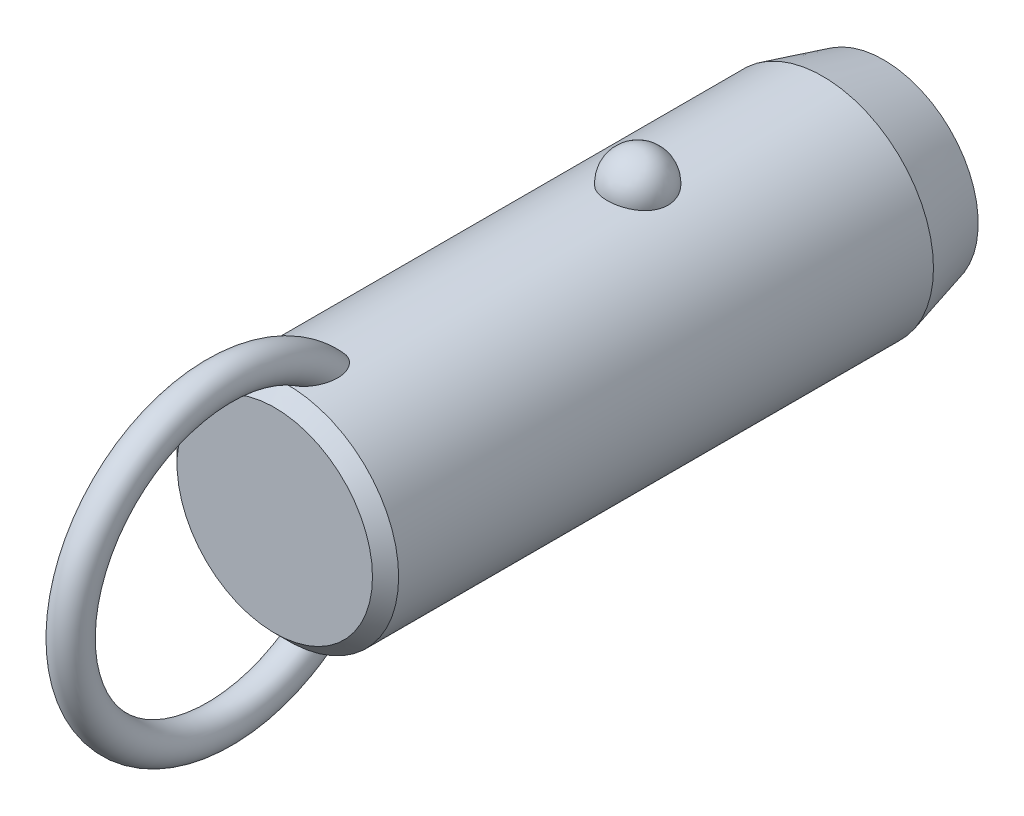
ISO-10303-21;
HEADER;
FILE_DESCRIPTION(('STEP AP214'),'2;1');
FILE_NAME('part.step','',(''),(''),'','','');
FILE_SCHEMA(('AUTOMOTIVE_DESIGN { 1 0 10303 214 1 1 1 1 }'));
ENDSEC;
DATA;
#1=APPLICATION_CONTEXT('core data for automotive mechanical design processes');
#2=APPLICATION_PROTOCOL_DEFINITION('international standard','automotive_design',2000,#1);
#3=PRODUCT_CONTEXT('',#1,'mechanical');
#4=PRODUCT('Part','Part','',(#3));
#5=PRODUCT_RELATED_PRODUCT_CATEGORY('part','',(#4));
#6=PRODUCT_DEFINITION_FORMATION('','',#4);
#7=PRODUCT_DEFINITION_CONTEXT('part definition',#1,'design');
#8=PRODUCT_DEFINITION('design','',#6,#7);
#9=PRODUCT_DEFINITION_SHAPE('','',#8);
#10=(LENGTH_UNIT() NAMED_UNIT(*) SI_UNIT(.MILLI.,.METRE.));
#11=(NAMED_UNIT(*) PLANE_ANGLE_UNIT() SI_UNIT($,.RADIAN.));
#12=(NAMED_UNIT(*) SI_UNIT($,.STERADIAN.) SOLID_ANGLE_UNIT());
#13=UNCERTAINTY_MEASURE_WITH_UNIT(LENGTH_MEASURE(1.E-05),#10,'distance_accuracy_value','');
#14=(GEOMETRIC_REPRESENTATION_CONTEXT(3) GLOBAL_UNCERTAINTY_ASSIGNED_CONTEXT((#13)) GLOBAL_UNIT_ASSIGNED_CONTEXT((#10,
#11,#12)) REPRESENTATION_CONTEXT('',''));
#15=CARTESIAN_POINT('',(0.,0.,0.));
#16=DIRECTION('',(0.,0.,1.));
#17=DIRECTION('',(1.,0.,0.));
#18=AXIS2_PLACEMENT_3D('',#15,#16,#17);
#19=CARTESIAN_POINT('',(0.,0.,25.4));
#20=DIRECTION('',(0.,0.,-1.));
#21=DIRECTION('',(-1.,0.,0.));
#22=AXIS2_PLACEMENT_3D('',#19,#20,#21);
#23=CYLINDRICAL_SURFACE('',#22,12.7);
#24=CARTESIAN_POINT('',(3.46661256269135,12.2177165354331,-3.5));
#25=CARTESIAN_POINT('',(3.4666090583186,12.2177194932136,-3.30432790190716));
#26=CARTESIAN_POINT('',(3.45063567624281,12.2222841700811,-3.10861112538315));
#27=CARTESIAN_POINT('',(3.38712451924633,12.2400345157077,-2.72271899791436));
#28=CARTESIAN_POINT('',(3.33957415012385,12.2532236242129,-2.53254588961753));
#29=CARTESIAN_POINT('',(3.2141234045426,12.286724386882,-2.16324948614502));
#30=CARTESIAN_POINT('',(3.13623639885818,12.3070329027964,-1.98412136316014));
#31=CARTESIAN_POINT('',(2.95205930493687,12.3525018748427,-1.64180592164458));
#32=CARTESIAN_POINT('',(2.84577003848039,12.3776621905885,-1.47861814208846));
#33=CARTESIAN_POINT('',(2.60688050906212,12.4301712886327,-1.17190583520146));
#34=CARTESIAN_POINT('',(2.47415697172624,12.4575299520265,-1.02847897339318));
#35=CARTESIAN_POINT('',(2.18615174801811,12.5112810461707,-0.766177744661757));
#36=CARTESIAN_POINT('',(2.03087002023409,12.5376734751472,-0.647303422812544));
#37=CARTESIAN_POINT('',(1.70237334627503,12.5864761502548,-0.437732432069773));
#38=CARTESIAN_POINT('',(1.52920948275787,12.6088972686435,-0.34695830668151));
#39=CARTESIAN_POINT('',(1.16944170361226,12.6473352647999,-0.195750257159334));
#40=CARTESIAN_POINT('',(0.982839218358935,12.663352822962,-0.135313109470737));
#41=CARTESIAN_POINT('',(0.604961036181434,12.6869706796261,-0.0473241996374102));
#42=CARTESIAN_POINT('',(0.413823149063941,12.6947125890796,-0.0192185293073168));
#43=CARTESIAN_POINT('',(0.0293827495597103,12.7014203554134,0.00517254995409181));
#44=CARTESIAN_POINT('',(-0.163919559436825,12.7003870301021,0.00146092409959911));
#45=CARTESIAN_POINT('',(-0.544374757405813,12.689735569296,-0.0373939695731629));
#46=CARTESIAN_POINT('',(-0.731575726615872,12.6802364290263,-0.0721015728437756));
#47=CARTESIAN_POINT('',(-1.09733277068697,12.6538333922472,-0.171364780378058));
#48=CARTESIAN_POINT('',(-1.27588869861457,12.6369293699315,-0.23592089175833));
#49=CARTESIAN_POINT('',(-1.6204698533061,12.5973946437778,-0.393548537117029));
#50=CARTESIAN_POINT('',(-1.78641865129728,12.5747321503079,-0.48677898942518));
#51=CARTESIAN_POINT('',(-2.10030671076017,12.5261316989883,-0.699110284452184));
#52=CARTESIAN_POINT('',(-2.24824419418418,12.5001934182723,-0.818213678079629));
#53=CARTESIAN_POINT('',(-2.52491489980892,12.4472906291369,-1.08157124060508));
#54=CARTESIAN_POINT('',(-2.65324222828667,12.4203160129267,-1.22624992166));
#55=CARTESIAN_POINT('',(-2.88410007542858,12.3687509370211,-1.53528325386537));
#56=CARTESIAN_POINT('',(-2.98662883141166,12.3441606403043,-1.69963924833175));
#57=CARTESIAN_POINT('',(-3.16432417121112,12.2998199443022,-2.04548497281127));
#58=CARTESIAN_POINT('',(-3.23917525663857,12.2801261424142,-2.22714424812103));
#59=CARTESIAN_POINT('',(-3.35800573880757,12.248167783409,-2.6009138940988));
#60=CARTESIAN_POINT('',(-3.4019860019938,12.2359030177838,-2.79302397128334));
#61=CARTESIAN_POINT('',(-3.45784812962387,12.2202347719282,-3.18140279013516));
#62=CARTESIAN_POINT('',(-3.46986123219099,12.2167950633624,-3.37765118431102));
#63=CARTESIAN_POINT('',(-3.46186273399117,12.2190638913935,-3.76943689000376));
#64=CARTESIAN_POINT('',(-3.44185196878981,12.2247721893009,-3.96497421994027));
#65=CARTESIAN_POINT('',(-3.37048652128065,12.2446381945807,-4.34881728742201));
#66=CARTESIAN_POINT('',(-3.31928253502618,12.2587552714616,-4.53715319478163));
#67=CARTESIAN_POINT('',(-3.18693461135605,12.2938237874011,-4.90231727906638));
#68=CARTESIAN_POINT('',(-3.1057895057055,12.3147754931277,-5.07914500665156));
#69=CARTESIAN_POINT('',(-2.91506431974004,12.3613125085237,-5.4173205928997));
#70=CARTESIAN_POINT('',(-2.80533587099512,12.3869217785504,-5.57858147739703));
#71=CARTESIAN_POINT('',(-2.560414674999,12.4398525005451,-5.88013283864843));
#72=CARTESIAN_POINT('',(-2.42522099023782,12.4671740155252,-6.02042254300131));
#73=CARTESIAN_POINT('',(-2.1323357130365,12.5205965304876,-6.27662798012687));
#74=CARTESIAN_POINT('',(-1.97456596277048,12.5466928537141,-6.39245542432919));
#75=CARTESIAN_POINT('',(-1.64115839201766,12.5946384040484,-6.59583547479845));
#76=CARTESIAN_POINT('',(-1.46552179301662,12.6164879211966,-6.68339001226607));
#77=CARTESIAN_POINT('',(-1.10356050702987,12.6532533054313,-6.82682153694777));
#78=CARTESIAN_POINT('',(-0.917391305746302,12.6682500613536,-6.88306988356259));
#79=CARTESIAN_POINT('',(-0.537836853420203,12.6900288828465,-6.96386887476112));
#80=CARTESIAN_POINT('',(-0.344452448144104,12.6968119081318,-6.9884232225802));
#81=CARTESIAN_POINT('',(0.0402577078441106,12.7013667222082,-7.00496469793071));
#82=CARTESIAN_POINT('',(0.231556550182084,12.6993008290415,-6.99753844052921));
#83=CARTESIAN_POINT('',(0.610105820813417,12.6867505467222,-6.95166366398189));
#84=CARTESIAN_POINT('',(0.797356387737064,12.6762664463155,-6.91321620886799));
#85=CARTESIAN_POINT('',(1.16186657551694,12.6480587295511,-6.80658431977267));
#86=CARTESIAN_POINT('',(1.33915951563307,12.6303611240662,-6.73850666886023));
#87=CARTESIAN_POINT('',(1.67968518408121,12.5896027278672,-6.57450875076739));
#88=CARTESIAN_POINT('',(1.84291705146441,12.5665416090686,-6.47858678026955));
#89=CARTESIAN_POINT('',(2.15340192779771,12.5171072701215,-6.25982455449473));
#90=CARTESIAN_POINT('',(2.30037831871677,12.4906895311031,-6.13660186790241));
#91=CARTESIAN_POINT('',(2.5717412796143,12.4376567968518,-5.86739587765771));
#92=CARTESIAN_POINT('',(2.69612388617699,12.4110417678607,-5.72140858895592));
#93=CARTESIAN_POINT('',(2.92107785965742,12.360051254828,-5.40794137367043));
#94=CARTESIAN_POINT('',(3.02121329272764,12.3357209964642,-5.24014110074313));
#95=CARTESIAN_POINT('',(3.19236291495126,12.2925446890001,-4.8896986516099));
#96=CARTESIAN_POINT('',(3.26338839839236,12.2736965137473,-4.70706226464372));
#97=CARTESIAN_POINT('',(3.36788038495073,12.245404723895,-4.35469510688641));
#98=CARTESIAN_POINT('',(3.40484026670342,12.2351018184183,-4.18605935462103));
#99=CARTESIAN_POINT('',(3.45420764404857,12.2212564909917,-3.84496058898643));
#100=CARTESIAN_POINT('',(3.46661565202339,12.2177139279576,-3.67249765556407));
#101=CARTESIAN_POINT('',(3.46661256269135,12.2177165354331,-3.5));
#102=B_SPLINE_CURVE_WITH_KNOTS('',3,(#24,#25,#26,#27,#28,#29,#30,#31,#32,#33,#34,#35,#36,#37,
#38,#39,#40,#41,#42,#43,#44,#45,#46,#47,#48,#49,#50,#51,#52,#53,#54,#55,#56,#57,#58,#59,#60,#61,
#62,#63,#64,#65,#66,#67,#68,#69,#70,#71,#72,#73,#74,#75,#76,#77,#78,#79,#80,#81,#82,#83,#84,#85,
#86,#87,#88,#89,#90,#91,#92,#93,#94,#95,#96,#97,#98,#99,#100,#101),.UNSPECIFIED.,.T.,.F.,(4,2,2,
2,2,2,2,2,2,2,2,2,2,2,2,2,2,2,2,2,2,2,2,2,2,2,2,2,2,2,2,2,2,2,2,2,2,2,4),(0.,0.586396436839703,
1.17302689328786,1.7593990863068,2.34575431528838,2.93491084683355,3.52406845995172,
4.1115873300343,4.69904375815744,5.2762784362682,5.85345931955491,6.42265312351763,
6.99185659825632,7.56427334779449,8.136746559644,8.71981013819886,9.3029135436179,
9.89247258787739,10.4820150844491,11.0691335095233,11.6562366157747,12.2405256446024,
12.8248374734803,13.412244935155,13.9996740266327,14.5891883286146,15.1786623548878,
15.7609861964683,16.3432419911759,16.914863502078,17.4864654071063,18.056024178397,
18.6256177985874,19.2037609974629,19.7820055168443,20.3699810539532,20.9577282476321,
21.4746855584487,21.9916320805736),.UNSPECIFIED.);
#103=CARTESIAN_POINT('',(3.46661256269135,12.2177165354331,-3.5));
#104=VERTEX_POINT('',#103);
#105=EDGE_CURVE('E41',#104,#104,#102,.T.);
#106=ORIENTED_EDGE('',*,*,#105,.T.);
#107=EDGE_LOOP('',(#106));
#108=FACE_BOUND('',#107,.T.);
#109=CARTESIAN_POINT('',(0.,0.,36.6));
#110=DIRECTION('',(0.,0.,1.));
#111=DIRECTION('',(1.,0.,0.));
#112=AXIS2_PLACEMENT_3D('',#109,#110,#111);
#113=CIRCLE('',#112,12.7);
#114=CARTESIAN_POINT('',(12.7,0.,36.6));
#115=VERTEX_POINT('',#114);
#116=EDGE_CURVE('E10',#115,#115,#113,.F.);
#117=ORIENTED_EDGE('',*,*,#116,.T.);
#118=EDGE_LOOP('',(#117));
#119=FACE_BOUND('',#118,.T.);
#120=CARTESIAN_POINT('',(-0.548122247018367,-12.6881662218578,30.3432187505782));
#121=CARTESIAN_POINT('',(-0.648865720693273,-12.6838128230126,30.377926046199));
#122=CARTESIAN_POINT('',(-0.746398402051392,-12.6783867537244,30.4220428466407));
#123=CARTESIAN_POINT('',(-0.932125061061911,-12.666091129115,30.5267647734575));
#124=CARTESIAN_POINT('',(-1.02030388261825,-12.6592192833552,30.5873961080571));
#125=CARTESIAN_POINT('',(-1.18487740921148,-12.6448747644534,30.721847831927));
#126=CARTESIAN_POINT('',(-1.26134296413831,-12.637406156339,30.7955825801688));
#127=CARTESIAN_POINT('',(-1.4023120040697,-12.6225412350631,30.9536045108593));
#128=CARTESIAN_POINT('',(-1.46681470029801,-12.6151449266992,31.0378923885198));
#129=CARTESIAN_POINT('',(-1.60714786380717,-12.5981718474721,31.2496577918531));
#130=CARTESIAN_POINT('',(-1.67725126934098,-12.588900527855,31.380962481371));
#131=CARTESIAN_POINT('',(-1.79536591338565,-12.5725964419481,31.6532471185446));
#132=CARTESIAN_POINT('',(-1.84333535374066,-12.5655679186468,31.7942447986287));
#133=CARTESIAN_POINT('',(-1.93422576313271,-12.5519624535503,32.1376455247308));
#134=CARTESIAN_POINT('',(-1.96788773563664,-12.5466298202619,32.3425578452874));
#135=CARTESIAN_POINT('',(-1.9941399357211,-12.542463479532,32.6517600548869));
#136=CARTESIAN_POINT('',(-1.99883864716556,-12.5417153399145,32.7552987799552));
#137=CARTESIAN_POINT('',(-2.00078003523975,-12.5414074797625,32.9624512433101));
#138=CARTESIAN_POINT('',(-1.99802449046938,-12.5418474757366,33.0660649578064));
#139=CARTESIAN_POINT('',(-1.98336733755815,-12.5441750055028,33.3103207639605));
#140=CARTESIAN_POINT('',(-1.96851430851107,-12.5465291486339,33.4507804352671));
#141=CARTESIAN_POINT('',(-1.92707089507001,-12.5529612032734,33.7299607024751));
#142=CARTESIAN_POINT('',(-1.900474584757,-12.5570399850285,33.8686803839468));
#143=CARTESIAN_POINT('',(-1.83619120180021,-12.5666008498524,34.1434113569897));
#144=CARTESIAN_POINT('',(-1.79850828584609,-12.57208240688,34.2794236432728));
#145=CARTESIAN_POINT('',(-1.71223796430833,-12.5841228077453,34.5478421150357));
#146=CARTESIAN_POINT('',(-1.66365679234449,-12.5906810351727,34.6802503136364));
#147=CARTESIAN_POINT('',(-1.57804503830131,-12.6016176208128,34.8854887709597));
#148=CARTESIAN_POINT('',(-1.54477252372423,-12.6057501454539,34.9599149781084));
#149=CARTESIAN_POINT('',(-1.47424480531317,-12.6141930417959,35.1068393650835));
#150=CARTESIAN_POINT('',(-1.43699041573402,-12.6185033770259,35.1793379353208));
#151=CARTESIAN_POINT('',(-1.35825795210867,-12.6272207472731,35.3218926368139));
#152=CARTESIAN_POINT('',(-1.31678520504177,-12.6316276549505,35.3919517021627));
#153=CARTESIAN_POINT('',(-1.22917793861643,-12.6404532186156,35.5290705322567));
#154=CARTESIAN_POINT('',(-1.18304514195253,-12.6448718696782,35.5961313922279));
#155=CARTESIAN_POINT('',(-1.0724641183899,-12.6547893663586,35.7438741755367));
#156=CARTESIAN_POINT('',(-1.00642239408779,-12.6602600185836,35.8233844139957));
#157=CARTESIAN_POINT('',(-0.86444142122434,-12.6707460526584,35.9731698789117));
#158=CARTESIAN_POINT('',(-0.788516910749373,-12.6757620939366,36.0434585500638));
#159=CARTESIAN_POINT('',(-0.652215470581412,-12.6833591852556,36.1486801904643));
#160=CARTESIAN_POINT('',(-0.594982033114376,-12.6861973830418,36.1876241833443));
#161=CARTESIAN_POINT('',(-0.475269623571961,-12.6912445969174,36.2564899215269));
#162=CARTESIAN_POINT('',(-0.412800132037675,-12.6934547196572,36.2864275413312));
#163=CARTESIAN_POINT('',(-0.295749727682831,-12.6966636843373,36.3297565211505));
#164=CARTESIAN_POINT('',(-0.241949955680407,-12.6978134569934,36.3452188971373));
#165=CARTESIAN_POINT('',(-0.132508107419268,-12.6994261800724,36.3668845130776));
#166=CARTESIAN_POINT('',(-0.076867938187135,-12.6998898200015,36.3730970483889));
#167=CARTESIAN_POINT('',(0.0347696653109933,-12.7000752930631,36.3755838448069));
#168=CARTESIAN_POINT('',(0.0907676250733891,-12.6997954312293,36.3718353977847));
#169=CARTESIAN_POINT('',(0.201283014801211,-12.6985255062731,36.3547883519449));
#170=CARTESIAN_POINT('',(0.255799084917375,-12.6975348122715,36.3414812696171));
#171=CARTESIAN_POINT('',(0.376042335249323,-12.6946091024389,36.3020379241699));
#172=CARTESIAN_POINT('',(0.44095085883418,-12.6924943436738,36.2734492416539));
#173=CARTESIAN_POINT('',(0.565350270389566,-12.6875639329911,36.2063234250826));
#174=CARTESIAN_POINT('',(0.624828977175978,-12.6847467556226,36.1677646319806));
#175=CARTESIAN_POINT('',(0.77411610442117,-12.6767252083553,36.056949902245));
#176=CARTESIAN_POINT('',(0.859449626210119,-12.6711344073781,35.9787605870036));
#177=CARTESIAN_POINT('',(1.01789440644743,-12.6593922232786,35.810943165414));
#178=CARTESIAN_POINT('',(1.09096902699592,-12.653239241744,35.721282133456));
#179=CARTESIAN_POINT('',(1.22268793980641,-12.6411674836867,35.5402658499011));
#180=CARTESIAN_POINT('',(1.28193986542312,-12.6352572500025,35.4493459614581));
#181=CARTESIAN_POINT('',(1.39259777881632,-12.6235401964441,35.262792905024));
#182=CARTESIAN_POINT('',(1.44399707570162,-12.6177334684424,35.167155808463));
#183=CARTESIAN_POINT('',(1.53972870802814,-12.6064093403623,34.9722738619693));
#184=CARTESIAN_POINT('',(1.58405262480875,-12.6008922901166,34.8730248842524));
#185=CARTESIAN_POINT('',(1.66600705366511,-12.5903187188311,34.6717727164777));
#186=CARTESIAN_POINT('',(1.70363651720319,-12.5852622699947,34.5697690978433));
#187=CARTESIAN_POINT('',(1.77545379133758,-12.5753406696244,34.3543580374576));
#188=CARTESIAN_POINT('',(1.80903453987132,-12.5705328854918,34.240745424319));
#189=CARTESIAN_POINT('',(1.86844163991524,-12.5618400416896,34.0114575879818));
#190=CARTESIAN_POINT('',(1.89426665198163,-12.5579551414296,33.8957820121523));
#191=CARTESIAN_POINT('',(1.93785464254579,-12.5513030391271,33.6630072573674));
#192=CARTESIAN_POINT('',(1.9556264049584,-12.5485346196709,33.5459097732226));
#193=CARTESIAN_POINT('',(1.98264463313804,-12.5442934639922,33.3107473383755));
#194=CARTESIAN_POINT('',(1.99189298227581,-12.5428204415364,33.1926826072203));
#195=CARTESIAN_POINT('',(2.00416068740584,-12.540871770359,32.8806225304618));
#196=CARTESIAN_POINT('',(1.99944433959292,-12.541631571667,32.6862290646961));
#197=CARTESIAN_POINT('',(1.96113755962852,-12.5476846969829,32.3003095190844));
#198=CARTESIAN_POINT('',(1.92758341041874,-12.5529723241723,32.1087801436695));
#199=CARTESIAN_POINT('',(1.83934342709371,-12.5661532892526,31.7822728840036));
#200=CARTESIAN_POINT('',(1.79215440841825,-12.5730485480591,31.6452499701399));
#201=CARTESIAN_POINT('',(1.6767624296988,-12.588958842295,31.380445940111));
#202=CARTESIAN_POINT('',(1.60859050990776,-12.597970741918,31.2526515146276));
#203=CARTESIAN_POINT('',(1.46583832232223,-12.6152829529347,31.0358006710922));
#204=CARTESIAN_POINT('',(1.39525727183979,-12.6233659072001,30.9441050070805));
#205=CARTESIAN_POINT('',(1.23992594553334,-12.6395676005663,30.7734854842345));
#206=CARTESIAN_POINT('',(1.15517932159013,-12.6476863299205,30.6945583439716));
#207=CARTESIAN_POINT('',(0.971995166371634,-12.6630846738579,30.5526438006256));
#208=CARTESIAN_POINT('',(0.873456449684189,-12.6703572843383,30.4897849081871));
#209=CARTESIAN_POINT('',(0.665847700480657,-12.6829569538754,30.3844870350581));
#210=CARTESIAN_POINT('',(0.556784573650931,-12.688285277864,30.3420347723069));
#211=CARTESIAN_POINT('',(0.347338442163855,-12.6956226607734,30.2844434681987));
#212=CARTESIAN_POINT('',(0.247759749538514,-12.6979816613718,30.2663996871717));
#213=CARTESIAN_POINT('',(0.0470218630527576,-12.7003077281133,30.2486007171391));
#214=CARTESIAN_POINT('',(-0.0541350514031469,-12.7002779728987,30.2488212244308));
#215=CARTESIAN_POINT('',(-0.221414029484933,-12.6982482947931,30.2643639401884));
#216=CARTESIAN_POINT('',(-0.288055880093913,-12.6969033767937,30.2746662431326));
#217=CARTESIAN_POINT('',(-0.419599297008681,-12.6932369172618,30.3031348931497));
#218=CARTESIAN_POINT('',(-0.484501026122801,-12.6909154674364,30.3213005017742));
#219=CARTESIAN_POINT('',(-0.548122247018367,-12.6881662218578,30.3432187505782));
#220=B_SPLINE_CURVE_WITH_KNOTS('',3,(#120,#121,#122,#123,#124,#125,#126,#127,#128,#129,#130,
#131,#132,#133,#134,#135,#136,#137,#138,#139,#140,#141,#142,#143,#144,#145,#146,#147,#148,#149,
#150,#151,#152,#153,#154,#155,#156,#157,#158,#159,#160,#161,#162,#163,#164,#165,#166,#167,#168,
#169,#170,#171,#172,#173,#174,#175,#176,#177,#178,#179,#180,#181,#182,#183,#184,#185,#186,#187,
#188,#189,#190,#191,#192,#193,#194,#195,#196,#197,#198,#199,#200,#201,#202,#203,#204,#205,#206,
#207,#208,#209,#210,#211,#212,#213,#214,#215,#216,#217,#218,#219),.UNSPECIFIED.,.T.,.F.,(4,2,2,
2,2,2,2,2,2,2,2,2,2,2,2,2,2,2,2,2,2,2,2,2,2,2,2,2,2,2,2,2,2,2,2,2,2,2,2,2,2,2,2,2,2,2,2,2,2,4),
(0.,0.319642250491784,0.639794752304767,0.957927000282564,1.27608021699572,1.72100165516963,
2.16675988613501,2.78630021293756,3.09705782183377,3.40774128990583,3.83096358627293,
4.25439969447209,4.67767724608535,5.10071330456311,5.34550297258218,5.59024267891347,
5.83467707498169,6.07902143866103,6.38891080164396,6.69834321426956,6.90560910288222,
7.11250749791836,7.27977315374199,7.44687060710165,7.61434932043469,7.78197685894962,
7.99365544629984,8.20579780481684,8.55147335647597,8.89816429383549,9.22375138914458,
9.54961437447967,9.87586224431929,10.2021611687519,10.557587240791,10.9130746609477,
11.2681734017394,11.6231936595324,12.2046601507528,12.7853961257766,13.219164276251,
13.6522938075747,13.9989174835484,14.3454519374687,14.6946768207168,15.0436740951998,
15.3457513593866,15.6474266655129,15.8493051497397,16.0511646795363),.UNSPECIFIED.);
#221=CARTESIAN_POINT('',(-0.548122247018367,-12.6881662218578,30.3432187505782));
#222=VERTEX_POINT('',#221);
#223=EDGE_CURVE('E60',#222,#222,#220,.T.);
#224=ORIENTED_EDGE('',*,*,#223,.T.);
#225=EDGE_LOOP('',(#224));
#226=FACE_BOUND('',#225,.T.);
#227=CARTESIAN_POINT('',(-0.548122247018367,12.6881662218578,30.3432187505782));
#228=CARTESIAN_POINT('',(-0.459436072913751,12.6919968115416,30.312673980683));
#229=CARTESIAN_POINT('',(-0.368189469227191,12.6949996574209,30.2893913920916));
#230=CARTESIAN_POINT('',(-0.183024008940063,12.6990186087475,30.2584062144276));
#231=CARTESIAN_POINT('',(-0.0891049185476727,12.7000345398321,30.2507049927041));
#232=CARTESIAN_POINT('',(0.0987147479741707,12.6999636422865,30.2512455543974));
#233=CARTESIAN_POINT('',(0.192615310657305,12.6988761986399,30.2594920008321));
#234=CARTESIAN_POINT('',(0.377658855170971,12.6947211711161,30.2915515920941));
#235=CARTESIAN_POINT('',(0.468801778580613,12.6916535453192,30.3153650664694));
#236=CARTESIAN_POINT('',(0.645809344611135,12.6838788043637,30.3774565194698));
#237=CARTESIAN_POINT('',(0.731679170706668,12.6791733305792,30.415720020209));
#238=CARTESIAN_POINT('',(0.896315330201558,12.6686004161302,30.5051204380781));
#239=CARTESIAN_POINT('',(0.975080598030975,12.6627328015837,30.5562592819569));
#240=CARTESIAN_POINT('',(1.12963655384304,12.6499161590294,30.6736782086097));
#241=CARTESIAN_POINT('',(1.20478673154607,12.6429194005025,30.7407929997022));
#242=CARTESIAN_POINT('',(1.34448241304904,12.6288282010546,30.8852250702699));
#243=CARTESIAN_POINT('',(1.40902173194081,12.621733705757,30.9625482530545));
#244=CARTESIAN_POINT('',(1.55208211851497,12.6050877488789,31.1592475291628));
#245=CARTESIAN_POINT('',(1.62510490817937,12.5957546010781,31.2826540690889));
#246=CARTESIAN_POINT('',(1.7501904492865,12.5789823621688,31.5397690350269));
#247=CARTESIAN_POINT('',(1.80221377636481,12.5715468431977,31.673496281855));
#248=CARTESIAN_POINT('',(1.90309965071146,12.5567434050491,31.9983516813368));
#249=CARTESIAN_POINT('',(1.94342317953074,12.5504515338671,32.1921611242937));
#250=CARTESIAN_POINT('',(1.99332997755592,12.5426147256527,32.5837881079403));
#251=CARTESIAN_POINT('',(2.00285305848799,12.5410790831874,32.7816127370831));
#252=CARTESIAN_POINT('',(1.99678999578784,12.5420407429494,33.1166427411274));
#253=CARTESIAN_POINT('',(1.98794117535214,12.5434564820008,33.2540428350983));
#254=CARTESIAN_POINT('',(1.95865119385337,12.5480641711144,33.5276394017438));
#255=CARTESIAN_POINT('',(1.9382043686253,12.5512569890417,33.6638352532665));
#256=CARTESIAN_POINT('',(1.88647896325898,12.5591352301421,33.9342493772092));
#257=CARTESIAN_POINT('',(1.85518800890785,12.5638223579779,34.0684652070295));
#258=CARTESIAN_POINT('',(1.78217886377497,12.5743868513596,34.3339362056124));
#259=CARTESIAN_POINT('',(1.74046509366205,12.5802637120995,34.4651926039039));
#260=CARTESIAN_POINT('',(1.66024095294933,12.5910571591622,34.6860855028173));
#261=CARTESIAN_POINT('',(1.62434772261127,12.5957535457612,34.7766904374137));
#262=CARTESIAN_POINT('',(1.5470900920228,12.6054762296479,34.9555125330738));
#263=CARTESIAN_POINT('',(1.50572681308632,12.6105024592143,35.0437301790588));
#264=CARTESIAN_POINT('',(1.41728020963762,12.620748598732,35.2169321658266));
#265=CARTESIAN_POINT('',(1.37021377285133,12.625967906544,35.3019251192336));
#266=CARTESIAN_POINT('',(1.26969620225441,12.6364721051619,35.4680072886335));
#267=CARTESIAN_POINT('',(1.21624929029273,12.6417569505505,35.5490990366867));
#268=CARTESIAN_POINT('',(1.10304413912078,12.6521331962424,35.7047027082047));
#269=CARTESIAN_POINT('',(1.04340936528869,12.657226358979,35.7793033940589));
#270=CARTESIAN_POINT('',(0.91591933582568,12.6670906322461,35.921324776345));
#271=CARTESIAN_POINT('',(0.848064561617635,12.6718617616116,35.9887458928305));
#272=CARTESIAN_POINT('',(0.717035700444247,12.67987711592,36.1006247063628));
#273=CARTESIAN_POINT('',(0.655526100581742,12.6832377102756,36.1469970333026));
#274=CARTESIAN_POINT('',(0.525985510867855,12.6892676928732,36.2296195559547));
#275=CARTESIAN_POINT('',(0.457969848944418,12.6919386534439,36.2658927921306));
#276=CARTESIAN_POINT('',(0.334859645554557,12.695691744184,36.3166572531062));
#277=CARTESIAN_POINT('',(0.281116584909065,12.6970073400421,36.3343733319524));
#278=CARTESIAN_POINT('',(0.171425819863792,12.6989609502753,36.3606429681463));
#279=CARTESIAN_POINT('',(0.115480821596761,12.699599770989,36.3692074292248));
#280=CARTESIAN_POINT('',(0.00272618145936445,12.7001251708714,36.3762531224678));
#281=CARTESIAN_POINT('',(-0.0540859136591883,12.7000089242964,36.3746964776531));
#282=CARTESIAN_POINT('',(-0.166544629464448,12.6990328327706,36.3616005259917));
#283=CARTESIAN_POINT('',(-0.222190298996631,12.6981724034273,36.3500533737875));
#284=CARTESIAN_POINT('',(-0.342018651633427,12.695562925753,36.3149128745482));
#285=CARTESIAN_POINT('',(-0.40560689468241,12.6936676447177,36.2893322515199));
#286=CARTESIAN_POINT('',(-0.527815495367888,12.6891754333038,36.228311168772));
#287=CARTESIAN_POINT('',(-0.586425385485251,12.6865770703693,36.1928505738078));
#288=CARTESIAN_POINT('',(-0.731842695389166,12.6792129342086,36.0914960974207));
#289=CARTESIAN_POINT('',(-0.814709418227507,12.6740767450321,36.0200395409));
#290=CARTESIAN_POINT('',(-0.969101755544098,12.6632083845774,35.8658900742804));
#291=CARTESIAN_POINT('',(-1.04059564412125,12.6574746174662,35.7831668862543));
#292=CARTESIAN_POINT('',(-1.16981116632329,12.6461638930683,35.6158096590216));
#293=CARTESIAN_POINT('',(-1.22811369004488,12.6405994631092,35.5316166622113));
#294=CARTESIAN_POINT('',(-1.33743405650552,12.6295007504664,35.3585791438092));
#295=CARTESIAN_POINT('',(-1.38844577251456,12.6239664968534,35.2697307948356));
#296=CARTESIAN_POINT('',(-1.48400702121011,12.6130898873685,35.088389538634));
#297=CARTESIAN_POINT('',(-1.52854232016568,12.6077479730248,34.9958891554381));
#298=CARTESIAN_POINT('',(-1.6115011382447,12.5974127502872,34.8081607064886));
#299=CARTESIAN_POINT('',(-1.64992317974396,12.5924195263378,34.7129319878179));
#300=CARTESIAN_POINT('',(-1.73468589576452,12.581070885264,34.4828936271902));
#301=CARTESIAN_POINT('',(-1.77831261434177,12.5749388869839,34.3470661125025));
#302=CARTESIAN_POINT('',(-1.85439734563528,12.5639437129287,34.0722128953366));
#303=CARTESIAN_POINT('',(-1.88684994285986,12.5590811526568,33.9331856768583));
#304=CARTESIAN_POINT('',(-1.94008483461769,12.550968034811,33.6530923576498));
#305=CARTESIAN_POINT('',(-1.96088706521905,12.5477147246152,33.5120301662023));
#306=CARTESIAN_POINT('',(-1.99000539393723,12.5431291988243,33.2286689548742));
#307=CARTESIAN_POINT('',(-1.99832911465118,12.5417958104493,33.0863707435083));
#308=CARTESIAN_POINT('',(-2.00166624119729,12.5412674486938,32.7576271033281));
#309=CARTESIAN_POINT('',(-1.99178843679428,12.5428579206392,32.571088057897));
#310=CARTESIAN_POINT('',(-1.9445518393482,12.5502731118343,32.2016240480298));
#311=CARTESIAN_POINT('',(-1.90724032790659,12.5560905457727,32.0186934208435));
#312=CARTESIAN_POINT('',(-1.81330718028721,12.5699462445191,31.7048488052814));
#313=CARTESIAN_POINT('',(-1.76338820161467,12.5771273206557,31.5719105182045));
#314=CARTESIAN_POINT('',(-1.64305018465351,12.593414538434,31.3156813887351));
#315=CARTESIAN_POINT('',(-1.57265346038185,12.6025185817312,31.192380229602));
#316=CARTESIAN_POINT('',(-1.42634956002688,12.6198178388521,30.9835648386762));
#317=CARTESIAN_POINT('',(-1.35423772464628,12.6278405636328,30.8953846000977));
#318=CARTESIAN_POINT('',(-1.19645664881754,12.6437632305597,30.732107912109));
#319=CARTESIAN_POINT('',(-1.11080536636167,12.6516633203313,30.6569944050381));
#320=CARTESIAN_POINT('',(-0.947219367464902,12.6648319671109,30.5378114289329));
#321=CARTESIAN_POINT('',(-0.871624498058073,12.670300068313,30.4905414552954));
#322=CARTESIAN_POINT('',(-0.714161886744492,12.6801492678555,30.4077413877));
#323=CARTESIAN_POINT('',(-0.6322953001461,12.684530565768,30.3722091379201));
#324=CARTESIAN_POINT('',(-0.548122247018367,12.6881662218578,30.3432187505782));
#325=B_SPLINE_CURVE_WITH_KNOTS('',3,(#227,#228,#229,#230,#231,#232,#233,#234,#235,#236,#237,
#238,#239,#240,#241,#242,#243,#244,#245,#246,#247,#248,#249,#250,#251,#252,#253,#254,#255,#256,
#257,#258,#259,#260,#261,#262,#263,#264,#265,#266,#267,#268,#269,#270,#271,#272,#273,#274,#275,
#276,#277,#278,#279,#280,#281,#282,#283,#284,#285,#286,#287,#288,#289,#290,#291,#292,#293,#294,
#295,#296,#297,#298,#299,#300,#301,#302,#303,#304,#305,#306,#307,#308,#309,#310,#311,#312,#313,
#314,#315,#316,#317,#318,#319,#320,#321,#322,#323,#324),.UNSPECIFIED.,.T.,.F.,(4,2,2,2,2,2,2,2,
2,2,2,2,2,2,2,2,2,2,2,2,2,2,2,2,2,2,2,2,2,2,2,2,2,2,2,2,2,2,2,2,2,2,2,2,2,2,2,2,4),(0.,
0.281328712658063,0.562682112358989,0.844117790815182,1.12555942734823,1.40671982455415,
1.68792232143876,1.98972294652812,2.2916988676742,2.72039860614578,3.1498994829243,
3.7408491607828,4.33295293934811,4.74554109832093,5.15833092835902,5.57159335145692,
5.98468079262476,6.27722775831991,6.56971484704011,6.86135609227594,7.15280542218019,
7.43927407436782,7.72572595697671,7.9563586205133,8.18646071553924,8.35559393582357,
8.52452541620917,8.69408946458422,8.86378678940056,9.06834348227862,9.27332014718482,
9.60010414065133,9.92778432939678,10.2350252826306,10.5425229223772,10.8506864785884,
11.1589244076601,11.5867893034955,12.0148612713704,12.4421984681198,12.8692745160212,
13.4279365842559,13.9856380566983,14.4107062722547,14.8353130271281,15.1765567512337,
15.5173516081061,15.7844129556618,16.051425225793),.UNSPECIFIED.);
#326=CARTESIAN_POINT('',(-0.548122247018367,12.6881662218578,30.3432187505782));
#327=VERTEX_POINT('',#326);
#328=EDGE_CURVE('E68',#327,#327,#325,.T.);
#329=ORIENTED_EDGE('',*,*,#328,.T.);
#330=EDGE_LOOP('',(#329));
#331=FACE_BOUND('',#330,.T.);
#332=CARTESIAN_POINT('',(0.,0.,-24.6999999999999));
#333=DIRECTION('',(0.,0.,-1.));
#334=DIRECTION('',(-1.,0.,0.));
#335=AXIS2_PLACEMENT_3D('',#332,#333,#334);
#336=CIRCLE('',#335,12.7);
#337=CARTESIAN_POINT('',(-12.7,0.,-24.6999999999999));
#338=VERTEX_POINT('',#337);
#339=EDGE_CURVE('E57',#338,#338,#336,.F.);
#340=ORIENTED_EDGE('',*,*,#339,.T.);
#341=EDGE_LOOP('',(#340));
#342=FACE_BOUND('',#341,.T.);
#343=ADVANCED_FACE('F37',(#108,#119,#226,#331,#342),#23,.T.);
#344=CARTESIAN_POINT('',(0.,0.,-31.7));
#345=DIRECTION('',(0.,0.,-1.));
#346=DIRECTION('',(-1.,0.,0.));
#347=AXIS2_PLACEMENT_3D('',#344,#345,#346);
#348=PLANE('',#347);
#349=CARTESIAN_POINT('',(0.,0.,-31.7));
#350=DIRECTION('',(0.,0.,-1.));
#351=DIRECTION('',(-1.,0.,0.));
#352=AXIS2_PLACEMENT_3D('',#349,#350,#351);
#353=CIRCLE('',#352,10.8243556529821);
#354=CARTESIAN_POINT('',(-10.8243556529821,0.,-31.7));
#355=VERTEX_POINT('',#354);
#356=EDGE_CURVE('E67',#355,#355,#353,.T.);
#357=ORIENTED_EDGE('',*,*,#356,.T.);
#358=EDGE_LOOP('',(#357));
#359=FACE_BOUND('',#358,.T.);
#360=ADVANCED_FACE('F86',(#359),#348,.T.);
#361=CARTESIAN_POINT('',(0.,0.,-31.7));
#362=DIRECTION('',(0.,0.,1.));
#363=DIRECTION('',(1.,0.,0.));
#364=AXIS2_PLACEMENT_3D('',#361,#362,#363);
#365=CONICAL_SURFACE('',#364,10.8243556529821,0.261799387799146);
#366=ORIENTED_EDGE('',*,*,#339,.F.);
#367=EDGE_LOOP('',(#366));
#368=FACE_BOUND('',#367,.T.);
#369=ORIENTED_EDGE('',*,*,#356,.F.);
#370=EDGE_LOOP('',(#369));
#371=FACE_BOUND('',#370,.T.);
#372=ADVANCED_FACE('F84',(#368,#371),#365,.T.);
#373=CARTESIAN_POINT('',(0.,0.,38.1));
#374=DIRECTION('',(0.,0.,1.));
#375=DIRECTION('',(1.,0.,0.));
#376=AXIS2_PLACEMENT_3D('',#373,#374,#375);
#377=PLANE('',#376);
#378=CARTESIAN_POINT('',(0.,0.,38.1));
#379=DIRECTION('',(0.,0.,1.));
#380=DIRECTION('',(1.,0.,0.));
#381=AXIS2_PLACEMENT_3D('',#378,#379,#380);
#382=CIRCLE('',#381,11.2);
#383=CARTESIAN_POINT('',(11.2,0.,38.1));
#384=VERTEX_POINT('',#383);
#385=EDGE_CURVE('E50',#384,#384,#382,.T.);
#386=ORIENTED_EDGE('',*,*,#385,.T.);
#387=EDGE_LOOP('',(#386));
#388=FACE_BOUND('',#387,.T.);
#389=ADVANCED_FACE('F78',(#388),#377,.T.);
#390=CARTESIAN_POINT('',(0.,0.,44.45));
#391=DIRECTION('',(1.,0.,0.));
#392=DIRECTION('',(0.,0.,-1.));
#393=AXIS2_PLACEMENT_3D('',#390,#391,#392);
#394=TOROIDAL_SURFACE('',#393,17.05,2.);
#395=ORIENTED_EDGE('',*,*,#328,.F.);
#396=EDGE_LOOP('',(#395));
#397=FACE_BOUND('',#396,.T.);
#398=ORIENTED_EDGE('',*,*,#223,.F.);
#399=EDGE_LOOP('',(#398));
#400=FACE_BOUND('',#399,.T.);
#401=ADVANCED_FACE('F74',(#397,#400),#394,.T.);
#402=CARTESIAN_POINT('',(0.,0.,38.1));
#403=DIRECTION('',(0.,0.,-1.));
#404=DIRECTION('',(-1.,0.,0.));
#405=AXIS2_PLACEMENT_3D('',#402,#403,#404);
#406=CONICAL_SURFACE('',#405,11.2,0.785398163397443);
#407=ORIENTED_EDGE('',*,*,#116,.F.);
#408=EDGE_LOOP('',(#407));
#409=FACE_BOUND('',#408,.T.);
#410=ORIENTED_EDGE('',*,*,#385,.F.);
#411=EDGE_LOOP('',(#410));
#412=FACE_BOUND('',#411,.T.);
#413=ADVANCED_FACE('F39',(#409,#412),#406,.T.);
#414=CARTESIAN_POINT('',(0.,12.7,-3.5));
#415=DIRECTION('',(0.,1.,0.));
#416=DIRECTION('',(0.,0.,1.));
#417=AXIS2_PLACEMENT_3D('',#414,#415,#416);
#418=SPHERICAL_SURFACE('',#417,3.5);
#419=ORIENTED_EDGE('',*,*,#105,.F.);
#420=EDGE_LOOP('',(#419));
#421=FACE_BOUND('',#420,.T.);
#422=ADVANCED_FACE('F80',(#421),#418,.T.);
#423=CLOSED_SHELL('',(#343,#360,#372,#389,#401,#413,#422));
#424=MANIFOLD_SOLID_BREP('B2',#423);
#425=ADVANCED_BREP_SHAPE_REPRESENTATION('',(#18,#424),#14);
#426=SHAPE_DEFINITION_REPRESENTATION(#9,#425);
ENDSEC;
END-ISO-10303-21;
